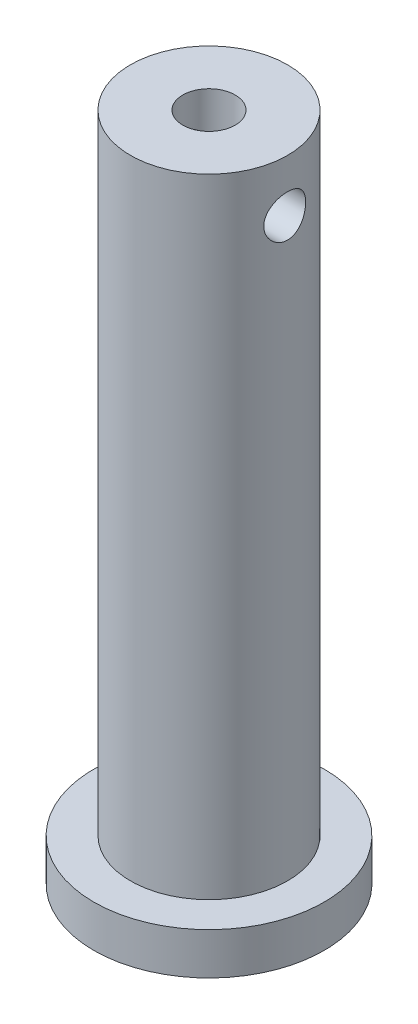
from build123d import *

# Parameters (mm, degrees)
PER_AGE1_D              = 2.5
PER_AGE1_DEPTH          = 17.5
PER_AGE1_TIP            = 0.751075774
ESQUISSE4_R             = 1
ENL_V_MAT_EXTRU_1_DEPTH = 5


with BuildPart() as part:
    # Esquisse1 → Base-R_volution (revolve)
    with BuildSketch(Plane.XY, mode=Mode.PRIVATE) as base_r_volution_sk:
        Polygon((0, 0), (5.5, 0), (5.5, 2), (3.75, 2), (3.75, 32), (0, 32), align=None)
    revolve(base_r_volution_sk.sketch.rotate(Axis((0, -9.927918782, 0), (0, 1, 0)), 90), axis=Axis((0, -9.927918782, 0), (0, 1, 0)))

    # Per_age1
    with Locations(Plane(origin=(0, 32, 0), x_dir=(-1, 0, 0), z_dir=(0, 1, 0))):
        with Locations((0, 0)):
            Hole(PER_AGE1_D / 2, depth=PER_AGE1_DEPTH)
            with Locations((0, 0, -(PER_AGE1_DEPTH + PER_AGE1_TIP / 2))):  # 118° drill point
                Cone(0, PER_AGE1_D / 2, PER_AGE1_TIP, mode=Mode.SUBTRACT)

    # Esquisse4 → Enl_v. mat.-Extru.1 (cut, symmetric)
    with BuildSketch(Plane(origin=(0, 0, 0), x_dir=(0, 0, -1), z_dir=(1, 0, 0))):
        with Locations((0, 29.5)):
            Circle(ESQUISSE4_R)
    extrude(amount=ENL_V_MAT_EXTRU_1_DEPTH, both=True, mode=Mode.SUBTRACT)


solid = part.part
